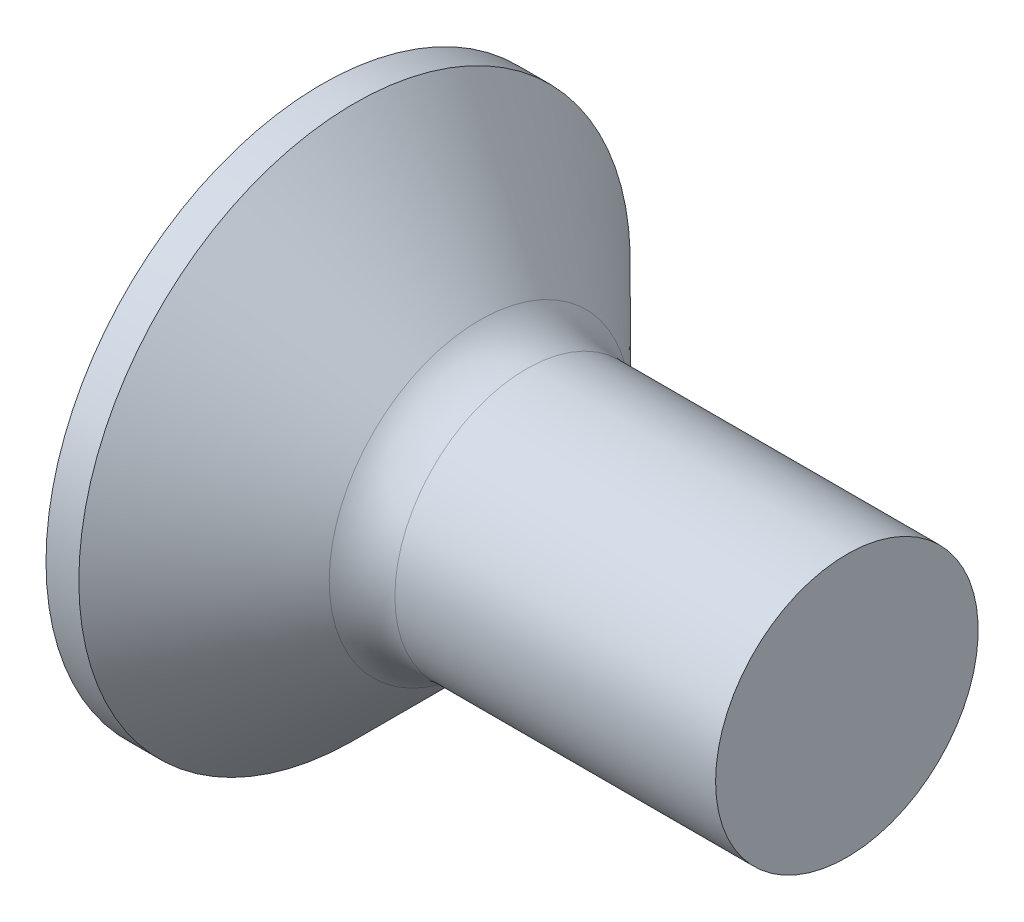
ISO-10303-21;
HEADER;
FILE_DESCRIPTION(('STEP AP214'),'2;1');
FILE_NAME('part.step','',(''),(''),'','','');
FILE_SCHEMA(('AUTOMOTIVE_DESIGN { 1 0 10303 214 1 1 1 1 }'));
ENDSEC;
DATA;
#1=APPLICATION_CONTEXT('core data for automotive mechanical design processes');
#2=APPLICATION_PROTOCOL_DEFINITION('international standard','automotive_design',2000,#1);
#3=PRODUCT_CONTEXT('',#1,'mechanical');
#4=PRODUCT('Part','Part','',(#3));
#5=PRODUCT_RELATED_PRODUCT_CATEGORY('part','',(#4));
#6=PRODUCT_DEFINITION_FORMATION('','',#4);
#7=PRODUCT_DEFINITION_CONTEXT('part definition',#1,'design');
#8=PRODUCT_DEFINITION('design','',#6,#7);
#9=PRODUCT_DEFINITION_SHAPE('','',#8);
#10=(LENGTH_UNIT() NAMED_UNIT(*) SI_UNIT(.MILLI.,.METRE.));
#11=(NAMED_UNIT(*) PLANE_ANGLE_UNIT() SI_UNIT($,.RADIAN.));
#12=(NAMED_UNIT(*) SI_UNIT($,.STERADIAN.) SOLID_ANGLE_UNIT());
#13=UNCERTAINTY_MEASURE_WITH_UNIT(LENGTH_MEASURE(1.E-05),#10,'distance_accuracy_value','');
#14=(GEOMETRIC_REPRESENTATION_CONTEXT(3) GLOBAL_UNCERTAINTY_ASSIGNED_CONTEXT((#13)) GLOBAL_UNIT_ASSIGNED_CONTEXT((#10,
#11,#12)) REPRESENTATION_CONTEXT('',''));
#15=CARTESIAN_POINT('',(0.,0.,0.));
#16=DIRECTION('',(0.,0.,1.));
#17=DIRECTION('',(1.,0.,0.));
#18=AXIS2_PLACEMENT_3D('',#15,#16,#17);
#19=CARTESIAN_POINT('',(0.,0.,0.));
#20=DIRECTION('',(-1.,0.,0.));
#21=DIRECTION('',(0.,0.,1.));
#22=AXIS2_PLACEMENT_3D('',#19,#20,#21);
#23=PLANE('',#22);
#24=CARTESIAN_POINT('',(0.,0.,0.));
#25=DIRECTION('',(-1.,0.,0.));
#26=DIRECTION('',(0.,0.,1.));
#27=AXIS2_PLACEMENT_3D('',#24,#25,#26);
#28=CIRCLE('',#27,4.2);
#29=CARTESIAN_POINT('',(0.,0.,4.2));
#30=VERTEX_POINT('',#29);
#31=EDGE_CURVE('E367',#30,#30,#28,.T.);
#32=ORIENTED_EDGE('',*,*,#31,.T.);
#33=EDGE_LOOP('',(#32));
#34=FACE_BOUND('',#33,.T.);
#35=DIRECTION('',(0.,0.,-1.));
#36=VECTOR('',#35,1.);
#37=CARTESIAN_POINT('',(0.,-0.515000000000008,2.2));
#38=LINE('',#37,#36);
#39=CARTESIAN_POINT('',(0.,-0.515000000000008,2.2));
#40=VERTEX_POINT('',#39);
#41=CARTESIAN_POINT('',(0.,-0.515000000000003,0.887981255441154));
#42=VERTEX_POINT('',#41);
#43=EDGE_CURVE('E305',#40,#42,#38,.T.);
#44=ORIENTED_EDGE('',*,*,#43,.T.);
#45=CARTESIAN_POINT('',(0.,0.,0.));
#46=DIRECTION('',(-1.,0.,0.));
#47=DIRECTION('',(0.,0.,1.));
#48=AXIS2_PLACEMENT_3D('',#45,#46,#47);
#49=CIRCLE('',#48,1.02651629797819);
#50=CARTESIAN_POINT('',(0.,-0.887981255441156,0.515));
#51=VERTEX_POINT('',#50);
#52=EDGE_CURVE('E396',#51,#42,#49,.T.);
#53=ORIENTED_EDGE('',*,*,#52,.F.);
#54=DIRECTION('',(0.,-1.,0.));
#55=VECTOR('',#54,1.);
#56=CARTESIAN_POINT('',(0.,2.2,0.515));
#57=LINE('',#56,#55);
#58=CARTESIAN_POINT('',(0.,-2.2,0.515));
#59=VERTEX_POINT('',#58);
#60=EDGE_CURVE('E331',#51,#59,#57,.T.);
#61=ORIENTED_EDGE('',*,*,#60,.T.);
#62=DIRECTION('',(0.,0.,-1.));
#63=VECTOR('',#62,1.);
#64=CARTESIAN_POINT('',(0.,-2.2,0.515));
#65=LINE('',#64,#63);
#66=CARTESIAN_POINT('',(0.,-2.2,-0.514999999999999));
#67=VERTEX_POINT('',#66);
#68=EDGE_CURVE('E336',#59,#67,#65,.T.);
#69=ORIENTED_EDGE('',*,*,#68,.T.);
#70=DIRECTION('',(0.,1.,0.));
#71=VECTOR('',#70,1.);
#72=CARTESIAN_POINT('',(0.,-2.2,-0.514999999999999));
#73=LINE('',#72,#71);
#74=CARTESIAN_POINT('',(0.,-0.887981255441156,-0.514999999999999));
#75=VERTEX_POINT('',#74);
#76=EDGE_CURVE('E332',#67,#75,#73,.T.);
#77=ORIENTED_EDGE('',*,*,#76,.T.);
#78=CARTESIAN_POINT('',(0.,-0.514999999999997,-0.887981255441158));
#79=VERTEX_POINT('',#78);
#80=EDGE_CURVE('E403',#79,#75,#49,.T.);
#81=ORIENTED_EDGE('',*,*,#80,.F.);
#82=CARTESIAN_POINT('',(0.,-0.514999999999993,-2.2));
#83=VERTEX_POINT('',#82);
#84=EDGE_CURVE('E303',#79,#83,#38,.T.);
#85=ORIENTED_EDGE('',*,*,#84,.T.);
#86=DIRECTION('',(0.,1.,0.));
#87=VECTOR('',#86,1.);
#88=CARTESIAN_POINT('',(0.,-0.514999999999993,-2.2));
#89=LINE('',#88,#87);
#90=CARTESIAN_POINT('',(0.,0.515000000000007,-2.2));
#91=VERTEX_POINT('',#90);
#92=EDGE_CURVE('E284',#83,#91,#89,.T.);
#93=ORIENTED_EDGE('',*,*,#92,.T.);
#94=DIRECTION('',(0.,0.,1.));
#95=VECTOR('',#94,1.);
#96=CARTESIAN_POINT('',(0.,0.515000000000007,-2.2));
#97=LINE('',#96,#95);
#98=CARTESIAN_POINT('',(0.,0.515000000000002,-0.887981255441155));
#99=VERTEX_POINT('',#98);
#100=EDGE_CURVE('E295',#91,#99,#97,.T.);
#101=ORIENTED_EDGE('',*,*,#100,.T.);
#102=CARTESIAN_POINT('',(0.,0.887981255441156,-0.514999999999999));
#103=VERTEX_POINT('',#102);
#104=EDGE_CURVE('E399',#103,#99,#49,.T.);
#105=ORIENTED_EDGE('',*,*,#104,.F.);
#106=CARTESIAN_POINT('',(0.,2.2,-0.514999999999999));
#107=VERTEX_POINT('',#106);
#108=EDGE_CURVE('E342',#103,#107,#73,.T.);
#109=ORIENTED_EDGE('',*,*,#108,.T.);
#110=DIRECTION('',(0.,0.,1.));
#111=VECTOR('',#110,1.);
#112=CARTESIAN_POINT('',(0.,2.2,-0.514999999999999));
#113=LINE('',#112,#111);
#114=CARTESIAN_POINT('',(0.,2.2,0.515));
#115=VERTEX_POINT('',#114);
#116=EDGE_CURVE('E328',#107,#115,#113,.T.);
#117=ORIENTED_EDGE('',*,*,#116,.T.);
#118=CARTESIAN_POINT('',(0.,0.887981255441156,0.515));
#119=VERTEX_POINT('',#118);
#120=EDGE_CURVE('E333',#115,#119,#57,.T.);
#121=ORIENTED_EDGE('',*,*,#120,.T.);
#122=CARTESIAN_POINT('',(0.,0.514999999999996,0.887981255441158));
#123=VERTEX_POINT('',#122);
#124=EDGE_CURVE('E398',#123,#119,#49,.T.);
#125=ORIENTED_EDGE('',*,*,#124,.F.);
#126=CARTESIAN_POINT('',(0.,0.514999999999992,2.2));
#127=VERTEX_POINT('',#126);
#128=EDGE_CURVE('E298',#123,#127,#97,.T.);
#129=ORIENTED_EDGE('',*,*,#128,.T.);
#130=DIRECTION('',(0.,-1.,0.));
#131=VECTOR('',#130,1.);
#132=CARTESIAN_POINT('',(0.,0.514999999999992,2.2));
#133=LINE('',#132,#131);
#134=EDGE_CURVE('E297',#127,#40,#133,.T.);
#135=ORIENTED_EDGE('',*,*,#134,.T.);
#136=EDGE_LOOP('',(#44,#53,#61,#69,#77,#81,#85,#93,#101,#105,#109,#117,#121,#125,#129,#135));
#137=FACE_BOUND('',#136,.T.);
#138=ADVANCED_FACE('F30',(#34,#137),#23,.T.);
#139=CARTESIAN_POINT('',(2.51,-0.948560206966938,0.515));
#140=DIRECTION('',(0.,0.,-1.));
#141=DIRECTION('',(0.,1.,0.));
#142=AXIS2_PLACEMENT_3D('',#139,#140,#141);
#143=PLANE('',#142);
#144=ORIENTED_EDGE('',*,*,#60,.F.);
#145=CARTESIAN_POINT('',(-1.54977564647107,-1.01130800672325,0.515));
#146=CARTESIAN_POINT('',(-1.23788517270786,-0.986826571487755,0.515));
#147=CARTESIAN_POINT('',(-0.92600773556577,-0.962176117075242,0.515));
#148=CARTESIAN_POINT('',(-0.302275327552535,-0.912414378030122,0.515));
#149=CARTESIAN_POINT('',(0.0095796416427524,-0.88730307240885,0.515));
#150=CARTESIAN_POINT('',(0.477326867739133,-0.849200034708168,0.515));
#151=CARTESIAN_POINT('',(0.633236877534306,-0.836426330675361,0.515));
#152=CARTESIAN_POINT('',(0.945041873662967,-0.810710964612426,0.515));
#153=CARTESIAN_POINT('',(1.10093686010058,-0.797769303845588,0.515));
#154=CARTESIAN_POINT('',(1.41270333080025,-0.771692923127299,0.515));
#155=CARTESIAN_POINT('',(1.568574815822,-0.758558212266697,0.515));
#156=CARTESIAN_POINT('',(1.88030267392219,-0.732062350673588,0.515));
#157=CARTESIAN_POINT('',(2.03615904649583,-0.718701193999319,0.515));
#158=CARTESIAN_POINT('',(2.39015155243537,-0.688049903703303,0.515));
#159=CARTESIAN_POINT('',(2.58828060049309,-0.670677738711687,0.515));
#160=CARTESIAN_POINT('',(2.98448796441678,-0.63539350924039,0.515));
#161=CARTESIAN_POINT('',(3.18256628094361,-0.617481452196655,0.515));
#162=CARTESIAN_POINT('',(3.57863215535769,-0.58096323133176,0.515));
#163=CARTESIAN_POINT('',(3.77661972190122,-0.562357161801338,0.515));
#164=CARTESIAN_POINT('',(4.17251625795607,-0.524212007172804,0.515));
#165=CARTESIAN_POINT('',(4.37042522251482,-0.504672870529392,0.515));
#166=CARTESIAN_POINT('',(4.76621979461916,-0.464285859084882,0.515));
#167=CARTESIAN_POINT('',(4.96410533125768,-0.443437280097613,0.515000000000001));
#168=CARTESIAN_POINT('',(5.26075347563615,-0.410686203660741,0.515000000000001));
#169=CARTESIAN_POINT('',(5.35959766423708,-0.399523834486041,0.515000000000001));
#170=CARTESIAN_POINT('',(5.55721694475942,-0.376561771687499,0.515000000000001));
#171=CARTESIAN_POINT('',(5.65599203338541,-0.364762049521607,0.515000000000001));
#172=CARTESIAN_POINT('',(5.85350341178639,-0.340311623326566,0.515000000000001));
#173=CARTESIAN_POINT('',(5.95223963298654,-0.327660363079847,0.515000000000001));
#174=CARTESIAN_POINT('',(6.14954565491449,-0.301187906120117,0.515000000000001));
#175=CARTESIAN_POINT('',(6.24811547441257,-0.28736685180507,0.515000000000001));
#176=CARTESIAN_POINT('',(6.39580251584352,-0.265292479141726,0.515000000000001));
#177=CARTESIAN_POINT('',(6.44501926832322,-0.257707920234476,0.515000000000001));
#178=CARTESIAN_POINT('',(6.54335575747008,-0.241951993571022,0.515000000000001));
#179=CARTESIAN_POINT('',(6.59247550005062,-0.233780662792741,0.515000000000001));
#180=CARTESIAN_POINT('',(6.69060451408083,-0.216664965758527,0.515000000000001));
#181=CARTESIAN_POINT('',(6.73961373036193,-0.207720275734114,0.515000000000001));
#182=CARTESIAN_POINT('',(6.83741121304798,-0.188649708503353,0.515000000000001));
#183=CARTESIAN_POINT('',(6.8861994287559,-0.17852357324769,0.515000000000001));
#184=CARTESIAN_POINT('',(6.93482152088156,-0.167602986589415,0.515000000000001));
#185=B_SPLINE_CURVE_WITH_KNOTS('',3,(#145,#146,#147,#148,#149,#150,#151,#152,#153,#154,#155,
#156,#157,#158,#159,#160,#161,#162,#163,#164,#165,#166,#167,#168,#169,#170,#171,#172,#173,#174,
#175,#176,#177,#178,#179,#180,#181,#182,#183,#184),.UNSPECIFIED.,.F.,.F.,(4,2,2,2,2,2,2,2,2,2,2,
2,2,2,2,2,2,2,2,4),(0.,0.938549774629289,1.87714240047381,2.34643955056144,2.81573317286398,
3.28500476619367,3.75428869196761,4.35095567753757,4.94761444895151,5.54419244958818,
6.14080344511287,6.73773807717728,7.0361540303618,7.33458335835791,7.63320954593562,
7.93179943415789,8.08118980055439,8.23057076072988,8.38001456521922,8.52949107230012),.UNSPECIFIED.);
#186=CARTESIAN_POINT('',(2.51,-0.677477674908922,0.514999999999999));
#187=VERTEX_POINT('',#186);
#188=EDGE_CURVE('E410',#51,#187,#185,.T.);
#189=ORIENTED_EDGE('',*,*,#188,.T.);
#190=DIRECTION('',(0.,-1.,0.));
#191=VECTOR('',#190,1.);
#192=CARTESIAN_POINT('',(2.51,0.948560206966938,0.515));
#193=LINE('',#192,#191);
#194=CARTESIAN_POINT('',(2.51,-0.948560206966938,0.515));
#195=VERTEX_POINT('',#194);
#196=EDGE_CURVE('E356',#187,#195,#193,.T.);
#197=ORIENTED_EDGE('',*,*,#196,.T.);
#198=DIRECTION('',(0.89493436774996,0.446197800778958,0.));
#199=VECTOR('',#198,1.);
#200=CARTESIAN_POINT('',(0.,-2.2,0.515));
#201=LINE('',#200,#199);
#202=EDGE_CURVE('E343',#59,#195,#201,.T.);
#203=ORIENTED_EDGE('',*,*,#202,.F.);
#204=EDGE_LOOP('',(#144,#189,#197,#203));
#205=FACE_BOUND('',#204,.T.);
#206=ADVANCED_FACE('F162',(#205),#143,.T.);
#207=CARTESIAN_POINT('',(2.51,0.948560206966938,0.515));
#208=VERTEX_POINT('',#207);
#209=CARTESIAN_POINT('',(2.51,0.677477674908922,0.514999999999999));
#210=VERTEX_POINT('',#209);
#211=EDGE_CURVE('E357',#208,#210,#193,.T.);
#212=ORIENTED_EDGE('',*,*,#211,.T.);
#213=CARTESIAN_POINT('',(-1.54977564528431,1.01130800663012,0.515));
#214=CARTESIAN_POINT('',(-1.23788517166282,0.986826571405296,0.515));
#215=CARTESIAN_POINT('',(-0.926007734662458,0.962176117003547,0.515));
#216=CARTESIAN_POINT('',(-0.302275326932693,0.91241437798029,0.515));
#217=CARTESIAN_POINT('',(0.0095796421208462,0.887303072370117,0.515));
#218=CARTESIAN_POINT('',(0.477326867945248,0.849200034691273,0.515));
#219=CARTESIAN_POINT('',(0.63323687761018,0.836426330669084,0.515));
#220=CARTESIAN_POINT('',(0.945041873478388,0.810710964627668,0.515));
#221=CARTESIAN_POINT('',(1.10093685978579,0.797769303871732,0.515));
#222=CARTESIAN_POINT('',(1.41270333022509,0.771692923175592,0.515));
#223=CARTESIAN_POINT('',(1.56857481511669,0.758558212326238,0.515));
#224=CARTESIAN_POINT('',(1.8803026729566,0.732062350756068,0.515));
#225=CARTESIAN_POINT('',(2.03615904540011,0.718701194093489,0.515));
#226=CARTESIAN_POINT('',(2.39015155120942,0.688049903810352,0.515));
#227=CARTESIAN_POINT('',(2.58828059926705,0.670677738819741,0.515));
#228=CARTESIAN_POINT('',(2.98448796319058,0.635393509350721,0.515));
#229=CARTESIAN_POINT('',(3.18256627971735,0.617481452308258,0.515));
#230=CARTESIAN_POINT('',(3.57863215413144,0.580963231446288,0.515));
#231=CARTESIAN_POINT('',(3.77661972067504,0.56235716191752,0.515));
#232=CARTESIAN_POINT('',(4.17251625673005,0.524212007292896,0.515));
#233=CARTESIAN_POINT('',(4.37042522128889,0.504672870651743,0.515));
#234=CARTESIAN_POINT('',(4.76621979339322,0.464285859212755,0.515));
#235=CARTESIAN_POINT('',(4.96410533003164,0.443437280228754,0.515));
#236=CARTESIAN_POINT('',(5.26075347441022,0.410686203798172,0.515));
#237=CARTESIAN_POINT('',(5.35959766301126,0.399523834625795,0.515));
#238=CARTESIAN_POINT('',(5.5572169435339,0.376561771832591,0.515));
#239=CARTESIAN_POINT('',(5.65599203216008,0.364762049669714,0.515000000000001));
#240=CARTESIAN_POINT('',(5.85350341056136,0.340311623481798,0.515000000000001));
#241=CARTESIAN_POINT('',(5.95223963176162,0.327660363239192,0.515000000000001));
#242=CARTESIAN_POINT('',(6.14954565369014,0.301187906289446,0.515000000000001));
#243=CARTESIAN_POINT('',(6.24811547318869,0.28736685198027,0.515000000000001));
#244=CARTESIAN_POINT('',(6.39580251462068,0.265292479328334,0.515000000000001));
#245=CARTESIAN_POINT('',(6.44501926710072,0.257707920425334,0.515000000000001));
#246=CARTESIAN_POINT('',(6.54335575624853,0.241951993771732,0.515000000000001));
#247=CARTESIAN_POINT('',(6.5924754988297,0.233780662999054,0.515000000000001));
#248=CARTESIAN_POINT('',(6.69060451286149,0.216664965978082,0.515000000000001));
#249=CARTESIAN_POINT('',(6.73961372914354,0.207720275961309,0.515000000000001));
#250=CARTESIAN_POINT('',(6.83741121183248,0.18864970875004,0.515000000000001));
#251=CARTESIAN_POINT('',(6.88619942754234,0.178523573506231,0.515000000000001));
#252=CARTESIAN_POINT('',(6.9348215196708,0.167602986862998,0.515000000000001));
#253=B_SPLINE_CURVE_WITH_KNOTS('',3,(#213,#214,#215,#216,#217,#218,#219,#220,#221,#222,#223,
#224,#225,#226,#227,#228,#229,#230,#231,#232,#233,#234,#235,#236,#237,#238,#239,#240,#241,#242,
#243,#244,#245,#246,#247,#248,#249,#250,#251,#252),.UNSPECIFIED.,.F.,.F.,(4,2,2,2,2,2,2,2,2,2,2,
2,2,2,2,2,2,2,2,4),(0.,0.938549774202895,1.87714239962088,2.34643954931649,2.81573317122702,
3.2850047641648,3.75428868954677,4.35095567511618,4.9476144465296,5.544192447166,
6.1408034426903,6.73773807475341,7.03615402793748,7.33458335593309,7.63320954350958,
7.93179943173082,8.08118979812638,8.23057075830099,8.38001456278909,8.5294910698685),.UNSPECIFIED.);
#254=EDGE_CURVE('E222',#210,#119,#253,.F.);
#255=ORIENTED_EDGE('',*,*,#254,.T.);
#256=ORIENTED_EDGE('',*,*,#120,.F.);
#257=DIRECTION('',(0.89493436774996,-0.446197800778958,0.));
#258=VECTOR('',#257,1.);
#259=CARTESIAN_POINT('',(0.,2.2,0.515));
#260=LINE('',#259,#258);
#261=EDGE_CURVE('E58',#115,#208,#260,.T.);
#262=ORIENTED_EDGE('',*,*,#261,.T.);
#263=EDGE_LOOP('',(#212,#255,#256,#262));
#264=FACE_BOUND('',#263,.T.);
#265=ADVANCED_FACE('F167',(#264),#143,.T.);
#266=CARTESIAN_POINT('',(2.51,0.948560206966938,-0.515));
#267=DIRECTION('',(0.,0.,1.));
#268=DIRECTION('',(1.,0.,0.));
#269=AXIS2_PLACEMENT_3D('',#266,#267,#268);
#270=PLANE('',#269);
#271=DIRECTION('',(0.,1.,0.));
#272=VECTOR('',#271,1.);
#273=CARTESIAN_POINT('',(2.51,-0.948560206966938,-0.515));
#274=LINE('',#273,#272);
#275=CARTESIAN_POINT('',(2.51,-0.948560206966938,-0.515));
#276=VERTEX_POINT('',#275);
#277=CARTESIAN_POINT('',(2.51,-0.677477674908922,-0.514999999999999));
#278=VERTEX_POINT('',#277);
#279=EDGE_CURVE('E307',#276,#278,#274,.T.);
#280=ORIENTED_EDGE('',*,*,#279,.T.);
#281=CARTESIAN_POINT('',(-1.54977564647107,-1.01130800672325,-0.514999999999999));
#282=CARTESIAN_POINT('',(-1.23788517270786,-0.986826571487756,-0.514999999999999));
#283=CARTESIAN_POINT('',(-0.92600773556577,-0.962176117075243,-0.514999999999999));
#284=CARTESIAN_POINT('',(-0.302275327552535,-0.912414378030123,-0.514999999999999));
#285=CARTESIAN_POINT('',(0.00957964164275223,-0.88730307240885,-0.514999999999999));
#286=CARTESIAN_POINT('',(0.477326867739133,-0.849200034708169,-0.514999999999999));
#287=CARTESIAN_POINT('',(0.633236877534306,-0.836426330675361,-0.515));
#288=CARTESIAN_POINT('',(0.945041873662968,-0.810710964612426,-0.515));
#289=CARTESIAN_POINT('',(1.10093686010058,-0.797769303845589,-0.515));
#290=CARTESIAN_POINT('',(1.41270333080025,-0.771692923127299,-0.515));
#291=CARTESIAN_POINT('',(1.568574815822,-0.758558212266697,-0.515));
#292=CARTESIAN_POINT('',(1.88030267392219,-0.732062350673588,-0.515));
#293=CARTESIAN_POINT('',(2.03615904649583,-0.718701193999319,-0.515));
#294=CARTESIAN_POINT('',(2.39015155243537,-0.688049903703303,-0.515));
#295=CARTESIAN_POINT('',(2.58828060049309,-0.670677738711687,-0.515));
#296=CARTESIAN_POINT('',(2.98448796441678,-0.63539350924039,-0.515));
#297=CARTESIAN_POINT('',(3.18256628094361,-0.617481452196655,-0.515));
#298=CARTESIAN_POINT('',(3.57863215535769,-0.58096323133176,-0.515));
#299=CARTESIAN_POINT('',(3.77661972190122,-0.562357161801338,-0.515));
#300=CARTESIAN_POINT('',(4.17251625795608,-0.524212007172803,-0.515000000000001));
#301=CARTESIAN_POINT('',(4.37042522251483,-0.504672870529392,-0.515000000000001));
#302=CARTESIAN_POINT('',(4.76621979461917,-0.464285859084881,-0.515000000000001));
#303=CARTESIAN_POINT('',(4.96410533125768,-0.443437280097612,-0.515000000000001));
#304=CARTESIAN_POINT('',(5.26075347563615,-0.410686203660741,-0.515000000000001));
#305=CARTESIAN_POINT('',(5.35959766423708,-0.39952383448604,-0.515000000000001));
#306=CARTESIAN_POINT('',(5.55721694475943,-0.376561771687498,-0.515000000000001));
#307=CARTESIAN_POINT('',(5.65599203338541,-0.364762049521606,-0.515000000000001));
#308=CARTESIAN_POINT('',(5.8535034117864,-0.340311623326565,-0.515000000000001));
#309=CARTESIAN_POINT('',(5.95223963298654,-0.327660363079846,-0.515000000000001));
#310=CARTESIAN_POINT('',(6.14954565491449,-0.301187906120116,-0.515000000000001));
#311=CARTESIAN_POINT('',(6.24811547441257,-0.287366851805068,-0.515000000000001));
#312=CARTESIAN_POINT('',(6.39580251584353,-0.265292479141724,-0.515000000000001));
#313=CARTESIAN_POINT('',(6.44501926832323,-0.257707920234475,-0.515000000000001));
#314=CARTESIAN_POINT('',(6.54335575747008,-0.24195199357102,-0.515000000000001));
#315=CARTESIAN_POINT('',(6.59247550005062,-0.233780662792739,-0.515000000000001));
#316=CARTESIAN_POINT('',(6.69060451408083,-0.216664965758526,-0.515000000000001));
#317=CARTESIAN_POINT('',(6.73961373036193,-0.207720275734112,-0.515000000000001));
#318=CARTESIAN_POINT('',(6.83741121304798,-0.188649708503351,-0.515000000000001));
#319=CARTESIAN_POINT('',(6.88619942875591,-0.178523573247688,-0.515000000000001));
#320=CARTESIAN_POINT('',(6.93482152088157,-0.167602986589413,-0.515000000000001));
#321=B_SPLINE_CURVE_WITH_KNOTS('',3,(#281,#282,#283,#284,#285,#286,#287,#288,#289,#290,#291,
#292,#293,#294,#295,#296,#297,#298,#299,#300,#301,#302,#303,#304,#305,#306,#307,#308,#309,#310,
#311,#312,#313,#314,#315,#316,#317,#318,#319,#320),.UNSPECIFIED.,.F.,.F.,(4,2,2,2,2,2,2,2,2,2,2,
2,2,2,2,2,2,2,2,4),(0.,0.938549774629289,1.87714240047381,2.34643955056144,2.81573317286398,
3.28500476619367,3.75428869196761,4.35095567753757,4.94761444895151,5.54419244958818,
6.14080344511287,6.73773807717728,7.0361540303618,7.33458335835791,7.63320954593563,
7.93179943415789,8.0811898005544,8.23057076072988,8.38001456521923,8.52949107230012),.UNSPECIFIED.);
#322=EDGE_CURVE('E216',#278,#75,#321,.F.);
#323=ORIENTED_EDGE('',*,*,#322,.T.);
#324=ORIENTED_EDGE('',*,*,#76,.F.);
#325=DIRECTION('',(0.89493436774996,0.446197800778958,0.));
#326=VECTOR('',#325,1.);
#327=CARTESIAN_POINT('',(0.,-2.2,-0.514999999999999));
#328=LINE('',#327,#326);
#329=EDGE_CURVE('E346',#67,#276,#328,.T.);
#330=ORIENTED_EDGE('',*,*,#329,.T.);
#331=EDGE_LOOP('',(#280,#323,#324,#330));
#332=FACE_BOUND('',#331,.T.);
#333=ADVANCED_FACE('F202',(#332),#270,.T.);
#334=ORIENTED_EDGE('',*,*,#108,.F.);
#335=CARTESIAN_POINT('',(-1.54977564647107,1.01130800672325,-0.514999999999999));
#336=CARTESIAN_POINT('',(-1.23788517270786,0.986826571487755,-0.514999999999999));
#337=CARTESIAN_POINT('',(-0.92600773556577,0.962176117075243,-0.514999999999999));
#338=CARTESIAN_POINT('',(-0.302275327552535,0.912414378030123,-0.514999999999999));
#339=CARTESIAN_POINT('',(0.00957964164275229,0.88730307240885,-0.514999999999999));
#340=CARTESIAN_POINT('',(0.477326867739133,0.849200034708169,-0.514999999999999));
#341=CARTESIAN_POINT('',(0.633236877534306,0.836426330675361,-0.515));
#342=CARTESIAN_POINT('',(0.945041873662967,0.810710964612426,-0.515));
#343=CARTESIAN_POINT('',(1.10093686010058,0.797769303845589,-0.515));
#344=CARTESIAN_POINT('',(1.41270333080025,0.771692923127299,-0.515));
#345=CARTESIAN_POINT('',(1.568574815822,0.758558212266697,-0.515));
#346=CARTESIAN_POINT('',(1.88030267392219,0.732062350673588,-0.515));
#347=CARTESIAN_POINT('',(2.03615904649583,0.718701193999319,-0.515));
#348=CARTESIAN_POINT('',(2.39015155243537,0.688049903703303,-0.515));
#349=CARTESIAN_POINT('',(2.58828060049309,0.670677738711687,-0.515));
#350=CARTESIAN_POINT('',(2.98448796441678,0.63539350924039,-0.515));
#351=CARTESIAN_POINT('',(3.18256628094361,0.617481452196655,-0.515));
#352=CARTESIAN_POINT('',(3.57863215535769,0.58096323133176,-0.515));
#353=CARTESIAN_POINT('',(3.77661972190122,0.562357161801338,-0.515));
#354=CARTESIAN_POINT('',(4.17251625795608,0.524212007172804,-0.515000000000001));
#355=CARTESIAN_POINT('',(4.37042522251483,0.504672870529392,-0.515000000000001));
#356=CARTESIAN_POINT('',(4.76621979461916,0.464285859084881,-0.515000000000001));
#357=CARTESIAN_POINT('',(4.96410533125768,0.443437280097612,-0.515000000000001));
#358=CARTESIAN_POINT('',(5.26075347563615,0.410686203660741,-0.515000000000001));
#359=CARTESIAN_POINT('',(5.35959766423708,0.39952383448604,-0.515000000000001));
#360=CARTESIAN_POINT('',(5.55721694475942,0.376561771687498,-0.515000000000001));
#361=CARTESIAN_POINT('',(5.65599203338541,0.364762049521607,-0.515000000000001));
#362=CARTESIAN_POINT('',(5.8535034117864,0.340311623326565,-0.515000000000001));
#363=CARTESIAN_POINT('',(5.95223963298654,0.327660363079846,-0.515000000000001));
#364=CARTESIAN_POINT('',(6.14954565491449,0.301187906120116,-0.515000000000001));
#365=CARTESIAN_POINT('',(6.24811547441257,0.287366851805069,-0.515000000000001));
#366=CARTESIAN_POINT('',(6.39580251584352,0.265292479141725,-0.515000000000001));
#367=CARTESIAN_POINT('',(6.44501926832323,0.257707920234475,-0.515000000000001));
#368=CARTESIAN_POINT('',(6.54335575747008,0.24195199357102,-0.515000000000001));
#369=CARTESIAN_POINT('',(6.59247550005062,0.233780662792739,-0.515000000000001));
#370=CARTESIAN_POINT('',(6.69060451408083,0.216664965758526,-0.515000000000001));
#371=CARTESIAN_POINT('',(6.73961373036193,0.207720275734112,-0.515000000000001));
#372=CARTESIAN_POINT('',(6.83741121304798,0.188649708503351,-0.515000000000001));
#373=CARTESIAN_POINT('',(6.88619942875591,0.178523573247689,-0.515000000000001));
#374=CARTESIAN_POINT('',(6.93482152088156,0.167602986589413,-0.515000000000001));
#375=B_SPLINE_CURVE_WITH_KNOTS('',3,(#335,#336,#337,#338,#339,#340,#341,#342,#343,#344,#345,
#346,#347,#348,#349,#350,#351,#352,#353,#354,#355,#356,#357,#358,#359,#360,#361,#362,#363,#364,
#365,#366,#367,#368,#369,#370,#371,#372,#373,#374),.UNSPECIFIED.,.F.,.F.,(4,2,2,2,2,2,2,2,2,2,2,
2,2,2,2,2,2,2,2,4),(0.,0.938549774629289,1.87714240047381,2.34643955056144,2.81573317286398,
3.28500476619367,3.75428869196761,4.35095567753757,4.94761444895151,5.54419244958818,
6.14080344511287,6.73773807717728,7.0361540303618,7.33458335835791,7.63320954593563,
7.93179943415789,8.0811898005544,8.23057076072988,8.38001456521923,8.52949107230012),.UNSPECIFIED.);
#376=CARTESIAN_POINT('',(2.51,0.677477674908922,-0.514999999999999));
#377=VERTEX_POINT('',#376);
#378=EDGE_CURVE('E210',#103,#377,#375,.T.);
#379=ORIENTED_EDGE('',*,*,#378,.T.);
#380=CARTESIAN_POINT('',(2.51,0.948560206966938,-0.515));
#381=VERTEX_POINT('',#380);
#382=EDGE_CURVE('E304',#377,#381,#274,.T.);
#383=ORIENTED_EDGE('',*,*,#382,.T.);
#384=DIRECTION('',(0.89493436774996,-0.446197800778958,0.));
#385=VECTOR('',#384,1.);
#386=CARTESIAN_POINT('',(0.,2.2,-0.514999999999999));
#387=LINE('',#386,#385);
#388=EDGE_CURVE('E350',#107,#381,#387,.T.);
#389=ORIENTED_EDGE('',*,*,#388,.F.);
#390=EDGE_LOOP('',(#334,#379,#383,#389));
#391=FACE_BOUND('',#390,.T.);
#392=ADVANCED_FACE('F194',(#391),#270,.T.);
#393=CARTESIAN_POINT('',(2.51,-0.948560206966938,-0.515));
#394=DIRECTION('',(-1.,0.,0.));
#395=DIRECTION('',(0.,0.,1.));
#396=AXIS2_PLACEMENT_3D('',#393,#394,#395);
#397=PLANE('',#396);
#398=ORIENTED_EDGE('',*,*,#196,.F.);
#399=CARTESIAN_POINT('',(2.51,0.,0.));
#400=DIRECTION('',(-1.,0.,0.));
#401=DIRECTION('',(0.,0.,1.));
#402=AXIS2_PLACEMENT_3D('',#399,#400,#401);
#403=CIRCLE('',#402,0.850999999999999);
#404=EDGE_CURVE('E387',#278,#187,#403,.T.);
#405=ORIENTED_EDGE('',*,*,#404,.F.);
#406=ORIENTED_EDGE('',*,*,#279,.F.);
#407=DIRECTION('',(0.,0.,-1.));
#408=VECTOR('',#407,1.);
#409=CARTESIAN_POINT('',(2.51,-0.948560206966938,0.515));
#410=LINE('',#409,#408);
#411=EDGE_CURVE('E353',#195,#276,#410,.T.);
#412=ORIENTED_EDGE('',*,*,#411,.F.);
#413=EDGE_LOOP('',(#398,#405,#406,#412));
#414=FACE_BOUND('',#413,.T.);
#415=ADVANCED_FACE('F190',(#414),#397,.T.);
#416=DIRECTION('',(0.,0.,-1.));
#417=VECTOR('',#416,1.);
#418=CARTESIAN_POINT('',(2.51,-0.515000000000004,0.948560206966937));
#419=LINE('',#418,#417);
#420=CARTESIAN_POINT('',(2.51,-0.514999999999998,-0.677477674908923));
#421=VERTEX_POINT('',#420);
#422=CARTESIAN_POINT('',(2.51,-0.514999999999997,-0.94856020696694));
#423=VERTEX_POINT('',#422);
#424=EDGE_CURVE('E320',#421,#423,#419,.T.);
#425=ORIENTED_EDGE('',*,*,#424,.F.);
#426=CARTESIAN_POINT('',(2.51,0.515000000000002,-0.677477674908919));
#427=VERTEX_POINT('',#426);
#428=EDGE_CURVE('E394',#427,#421,#403,.T.);
#429=ORIENTED_EDGE('',*,*,#428,.F.);
#430=DIRECTION('',(0.,0.,1.));
#431=VECTOR('',#430,1.);
#432=CARTESIAN_POINT('',(2.51,0.515000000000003,-0.948560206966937));
#433=LINE('',#432,#431);
#434=CARTESIAN_POINT('',(2.51,0.515000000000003,-0.948560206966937));
#435=VERTEX_POINT('',#434);
#436=EDGE_CURVE('E321',#435,#427,#433,.T.);
#437=ORIENTED_EDGE('',*,*,#436,.F.);
#438=DIRECTION('',(0.,1.,0.));
#439=VECTOR('',#438,1.);
#440=CARTESIAN_POINT('',(2.51,-0.514999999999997,-0.94856020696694));
#441=LINE('',#440,#439);
#442=EDGE_CURVE('E287',#423,#435,#441,.T.);
#443=ORIENTED_EDGE('',*,*,#442,.F.);
#444=EDGE_LOOP('',(#425,#429,#437,#443));
#445=FACE_BOUND('',#444,.T.);
#446=ADVANCED_FACE('F193',(#445),#397,.T.);
#447=ORIENTED_EDGE('',*,*,#382,.F.);
#448=EDGE_CURVE('E397',#210,#377,#403,.T.);
#449=ORIENTED_EDGE('',*,*,#448,.F.);
#450=ORIENTED_EDGE('',*,*,#211,.F.);
#451=DIRECTION('',(0.,0.,1.));
#452=VECTOR('',#451,1.);
#453=CARTESIAN_POINT('',(2.51,0.948560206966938,-0.515));
#454=LINE('',#453,#452);
#455=EDGE_CURVE('E354',#381,#208,#454,.T.);
#456=ORIENTED_EDGE('',*,*,#455,.F.);
#457=EDGE_LOOP('',(#447,#449,#450,#456));
#458=FACE_BOUND('',#457,.T.);
#459=ADVANCED_FACE('F426',(#458),#397,.T.);
#460=CARTESIAN_POINT('',(2.51,0.514999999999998,0.677477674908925));
#461=VERTEX_POINT('',#460);
#462=CARTESIAN_POINT('',(2.51,0.514999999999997,0.94856020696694));
#463=VERTEX_POINT('',#462);
#464=EDGE_CURVE('E327',#461,#463,#433,.T.);
#465=ORIENTED_EDGE('',*,*,#464,.F.);
#466=CARTESIAN_POINT('',(2.51,-0.515000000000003,0.677477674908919));
#467=VERTEX_POINT('',#466);
#468=EDGE_CURVE('E395',#467,#461,#403,.T.);
#469=ORIENTED_EDGE('',*,*,#468,.F.);
#470=CARTESIAN_POINT('',(2.51,-0.515000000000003,0.948560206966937));
#471=VERTEX_POINT('',#470);
#472=EDGE_CURVE('E322',#471,#467,#419,.T.);
#473=ORIENTED_EDGE('',*,*,#472,.F.);
#474=DIRECTION('',(0.,-1.,0.));
#475=VECTOR('',#474,1.);
#476=CARTESIAN_POINT('',(2.51,0.514999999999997,0.94856020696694));
#477=LINE('',#476,#475);
#478=EDGE_CURVE('E317',#463,#471,#477,.T.);
#479=ORIENTED_EDGE('',*,*,#478,.F.);
#480=EDGE_LOOP('',(#465,#469,#473,#479));
#481=FACE_BOUND('',#480,.T.);
#482=ADVANCED_FACE('F196',(#481),#397,.T.);
#483=CARTESIAN_POINT('',(2.51,-0.514999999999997,-0.94856020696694));
#484=DIRECTION('',(0.,1.,0.));
#485=DIRECTION('',(0.,0.,1.));
#486=AXIS2_PLACEMENT_3D('',#483,#484,#485);
#487=PLANE('',#486);
#488=ORIENTED_EDGE('',*,*,#84,.F.);
#489=CARTESIAN_POINT('',(-1.54977564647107,-0.514999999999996,-1.01130800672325));
#490=CARTESIAN_POINT('',(-1.23788517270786,-0.514999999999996,-0.986826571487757));
#491=CARTESIAN_POINT('',(-0.92600773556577,-0.514999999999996,-0.962176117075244));
#492=CARTESIAN_POINT('',(-0.302275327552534,-0.514999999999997,-0.912414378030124));
#493=CARTESIAN_POINT('',(0.00957964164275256,-0.514999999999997,-0.887303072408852));
#494=CARTESIAN_POINT('',(0.477326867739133,-0.514999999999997,-0.84920003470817));
#495=CARTESIAN_POINT('',(0.633236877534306,-0.514999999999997,-0.836426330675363));
#496=CARTESIAN_POINT('',(0.945041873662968,-0.514999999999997,-0.810710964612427));
#497=CARTESIAN_POINT('',(1.10093686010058,-0.514999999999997,-0.79776930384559));
#498=CARTESIAN_POINT('',(1.41270333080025,-0.514999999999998,-0.771692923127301));
#499=CARTESIAN_POINT('',(1.568574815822,-0.514999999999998,-0.758558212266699));
#500=CARTESIAN_POINT('',(1.88030267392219,-0.514999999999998,-0.73206235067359));
#501=CARTESIAN_POINT('',(2.03615904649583,-0.514999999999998,-0.718701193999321));
#502=CARTESIAN_POINT('',(2.39015155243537,-0.514999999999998,-0.688049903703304));
#503=CARTESIAN_POINT('',(2.58828060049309,-0.514999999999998,-0.670677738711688));
#504=CARTESIAN_POINT('',(2.98448796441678,-0.514999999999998,-0.635393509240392));
#505=CARTESIAN_POINT('',(3.18256628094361,-0.514999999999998,-0.617481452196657));
#506=CARTESIAN_POINT('',(3.57863215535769,-0.514999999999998,-0.580963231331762));
#507=CARTESIAN_POINT('',(3.77661972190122,-0.514999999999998,-0.56235716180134));
#508=CARTESIAN_POINT('',(4.17251625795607,-0.514999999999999,-0.524212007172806));
#509=CARTESIAN_POINT('',(4.37042522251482,-0.514999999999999,-0.504672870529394));
#510=CARTESIAN_POINT('',(4.76621979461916,-0.514999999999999,-0.464285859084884));
#511=CARTESIAN_POINT('',(4.96410533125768,-0.514999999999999,-0.443437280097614));
#512=CARTESIAN_POINT('',(5.26075347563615,-0.514999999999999,-0.410686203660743));
#513=CARTESIAN_POINT('',(5.35959766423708,-0.514999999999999,-0.399523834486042));
#514=CARTESIAN_POINT('',(5.55721694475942,-0.514999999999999,-0.3765617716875));
#515=CARTESIAN_POINT('',(5.65599203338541,-0.514999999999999,-0.364762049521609));
#516=CARTESIAN_POINT('',(5.8535034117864,-0.514999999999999,-0.340311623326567));
#517=CARTESIAN_POINT('',(5.95223963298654,-0.514999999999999,-0.327660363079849));
#518=CARTESIAN_POINT('',(6.14954565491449,-0.515,-0.301187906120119));
#519=CARTESIAN_POINT('',(6.24811547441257,-0.515,-0.287366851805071));
#520=CARTESIAN_POINT('',(6.39580251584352,-0.515,-0.265292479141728));
#521=CARTESIAN_POINT('',(6.44501926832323,-0.515,-0.257707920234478));
#522=CARTESIAN_POINT('',(6.54335575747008,-0.515,-0.241951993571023));
#523=CARTESIAN_POINT('',(6.59247550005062,-0.515,-0.233780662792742));
#524=CARTESIAN_POINT('',(6.69060451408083,-0.515,-0.216664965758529));
#525=CARTESIAN_POINT('',(6.73961373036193,-0.515,-0.207720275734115));
#526=CARTESIAN_POINT('',(6.83741121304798,-0.515,-0.188649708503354));
#527=CARTESIAN_POINT('',(6.88619942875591,-0.515,-0.178523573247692));
#528=CARTESIAN_POINT('',(6.93482152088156,-0.515,-0.167602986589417));
#529=B_SPLINE_CURVE_WITH_KNOTS('',3,(#489,#490,#491,#492,#493,#494,#495,#496,#497,#498,#499,
#500,#501,#502,#503,#504,#505,#506,#507,#508,#509,#510,#511,#512,#513,#514,#515,#516,#517,#518,
#519,#520,#521,#522,#523,#524,#525,#526,#527,#528),.UNSPECIFIED.,.F.,.F.,(4,2,2,2,2,2,2,2,2,2,2,
2,2,2,2,2,2,2,2,4),(0.,0.938549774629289,1.87714240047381,2.34643955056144,2.81573317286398,
3.28500476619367,3.75428869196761,4.35095567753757,4.94761444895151,5.54419244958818,
6.14080344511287,6.73773807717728,7.03615403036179,7.33458335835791,7.63320954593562,
7.93179943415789,8.08118980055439,8.23057076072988,8.38001456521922,8.52949107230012),.UNSPECIFIED.);
#530=EDGE_CURVE('E247',#79,#421,#529,.T.);
#531=ORIENTED_EDGE('',*,*,#530,.T.);
#532=ORIENTED_EDGE('',*,*,#424,.T.);
#533=DIRECTION('',(0.89493436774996,0.,0.446197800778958));
#534=VECTOR('',#533,1.);
#535=CARTESIAN_POINT('',(0.,-0.514999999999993,-2.2));
#536=LINE('',#535,#534);
#537=EDGE_CURVE('E290',#83,#423,#536,.T.);
#538=ORIENTED_EDGE('',*,*,#537,.F.);
#539=EDGE_LOOP('',(#488,#531,#532,#538));
#540=FACE_BOUND('',#539,.T.);
#541=ADVANCED_FACE('F253',(#540),#487,.T.);
#542=CARTESIAN_POINT('',(2.51,0.514999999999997,0.94856020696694));
#543=DIRECTION('',(0.,-1.,0.));
#544=DIRECTION('',(1.,0.,0.));
#545=AXIS2_PLACEMENT_3D('',#542,#543,#544);
#546=PLANE('',#545);
#547=ORIENTED_EDGE('',*,*,#436,.T.);
#548=CARTESIAN_POINT('',(-1.54977564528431,0.515000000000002,-1.01130800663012));
#549=CARTESIAN_POINT('',(-1.23788517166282,0.515000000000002,-0.986826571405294));
#550=CARTESIAN_POINT('',(-0.926007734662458,0.515000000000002,-0.962176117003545));
#551=CARTESIAN_POINT('',(-0.302275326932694,0.515000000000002,-0.912414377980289));
#552=CARTESIAN_POINT('',(0.00957964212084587,0.515000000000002,-0.887303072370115));
#553=CARTESIAN_POINT('',(0.477326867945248,0.515000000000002,-0.849200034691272));
#554=CARTESIAN_POINT('',(0.63323687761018,0.515000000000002,-0.836426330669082));
#555=CARTESIAN_POINT('',(0.945041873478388,0.515000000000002,-0.810710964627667));
#556=CARTESIAN_POINT('',(1.10093685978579,0.515000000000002,-0.79776930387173));
#557=CARTESIAN_POINT('',(1.41270333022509,0.515000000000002,-0.77169292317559));
#558=CARTESIAN_POINT('',(1.56857481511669,0.515000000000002,-0.758558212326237));
#559=CARTESIAN_POINT('',(1.8803026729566,0.515000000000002,-0.732062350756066));
#560=CARTESIAN_POINT('',(2.03615904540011,0.515000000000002,-0.718701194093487));
#561=CARTESIAN_POINT('',(2.39015155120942,0.515000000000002,-0.68804990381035));
#562=CARTESIAN_POINT('',(2.58828059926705,0.515000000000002,-0.670677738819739));
#563=CARTESIAN_POINT('',(2.98448796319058,0.515000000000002,-0.635393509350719));
#564=CARTESIAN_POINT('',(3.18256627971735,0.515000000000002,-0.617481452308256));
#565=CARTESIAN_POINT('',(3.57863215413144,0.515000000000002,-0.580963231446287));
#566=CARTESIAN_POINT('',(3.77661972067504,0.515000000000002,-0.562357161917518));
#567=CARTESIAN_POINT('',(4.17251625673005,0.515000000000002,-0.524212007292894));
#568=CARTESIAN_POINT('',(4.37042522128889,0.515000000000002,-0.504672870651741));
#569=CARTESIAN_POINT('',(4.76621979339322,0.515000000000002,-0.464285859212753));
#570=CARTESIAN_POINT('',(4.96410533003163,0.515000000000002,-0.443437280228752));
#571=CARTESIAN_POINT('',(5.26075347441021,0.515000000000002,-0.410686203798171));
#572=CARTESIAN_POINT('',(5.35959766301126,0.515000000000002,-0.399523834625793));
#573=CARTESIAN_POINT('',(5.5572169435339,0.515000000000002,-0.376561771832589));
#574=CARTESIAN_POINT('',(5.65599203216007,0.515000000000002,-0.364762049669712));
#575=CARTESIAN_POINT('',(5.85350341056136,0.515000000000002,-0.340311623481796));
#576=CARTESIAN_POINT('',(5.95223963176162,0.515000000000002,-0.32766036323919));
#577=CARTESIAN_POINT('',(6.14954565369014,0.515000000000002,-0.301187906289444));
#578=CARTESIAN_POINT('',(6.24811547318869,0.515000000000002,-0.287366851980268));
#579=CARTESIAN_POINT('',(6.39580251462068,0.515000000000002,-0.265292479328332));
#580=CARTESIAN_POINT('',(6.44501926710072,0.515000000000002,-0.257707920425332));
#581=CARTESIAN_POINT('',(6.54335575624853,0.515000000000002,-0.24195199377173));
#582=CARTESIAN_POINT('',(6.5924754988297,0.515000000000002,-0.233780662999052));
#583=CARTESIAN_POINT('',(6.69060451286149,0.515000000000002,-0.216664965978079));
#584=CARTESIAN_POINT('',(6.73961372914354,0.515000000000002,-0.207720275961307));
#585=CARTESIAN_POINT('',(6.83741121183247,0.515000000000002,-0.188649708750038));
#586=CARTESIAN_POINT('',(6.88619942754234,0.515000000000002,-0.178523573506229));
#587=CARTESIAN_POINT('',(6.9348215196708,0.515000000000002,-0.167602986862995));
#588=B_SPLINE_CURVE_WITH_KNOTS('',3,(#548,#549,#550,#551,#552,#553,#554,#555,#556,#557,#558,
#559,#560,#561,#562,#563,#564,#565,#566,#567,#568,#569,#570,#571,#572,#573,#574,#575,#576,#577,
#578,#579,#580,#581,#582,#583,#584,#585,#586,#587),.UNSPECIFIED.,.F.,.F.,(4,2,2,2,2,2,2,2,2,2,2,
2,2,2,2,2,2,2,2,4),(0.,0.938549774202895,1.87714239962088,2.34643954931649,2.81573317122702,
3.2850047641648,3.75428868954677,4.35095567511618,4.9476144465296,5.544192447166,
6.1408034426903,6.7377380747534,7.03615402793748,7.33458335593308,7.63320954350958,
7.93179943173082,8.08118979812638,8.23057075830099,8.38001456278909,8.5294910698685),.UNSPECIFIED.);
#589=EDGE_CURVE('E242',#427,#99,#588,.F.);
#590=ORIENTED_EDGE('',*,*,#589,.T.);
#591=ORIENTED_EDGE('',*,*,#100,.F.);
#592=DIRECTION('',(0.89493436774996,0.,0.446197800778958));
#593=VECTOR('',#592,1.);
#594=CARTESIAN_POINT('',(0.,0.515000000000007,-2.2));
#595=LINE('',#594,#593);
#596=EDGE_CURVE('E280',#91,#435,#595,.T.);
#597=ORIENTED_EDGE('',*,*,#596,.T.);
#598=EDGE_LOOP('',(#547,#590,#591,#597));
#599=FACE_BOUND('',#598,.T.);
#600=ADVANCED_FACE('F256',(#599),#546,.T.);
#601=ORIENTED_EDGE('',*,*,#472,.T.);
#602=CARTESIAN_POINT('',(-1.54977564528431,-0.515000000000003,1.01130800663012));
#603=CARTESIAN_POINT('',(-1.23788517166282,-0.515000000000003,0.986826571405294));
#604=CARTESIAN_POINT('',(-0.926007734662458,-0.515000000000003,0.962176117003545));
#605=CARTESIAN_POINT('',(-0.302275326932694,-0.515000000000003,0.912414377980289));
#606=CARTESIAN_POINT('',(0.00957964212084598,-0.515000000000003,0.887303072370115));
#607=CARTESIAN_POINT('',(0.477326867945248,-0.515000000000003,0.849200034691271));
#608=CARTESIAN_POINT('',(0.633236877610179,-0.515000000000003,0.836426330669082));
#609=CARTESIAN_POINT('',(0.945041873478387,-0.515000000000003,0.810710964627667));
#610=CARTESIAN_POINT('',(1.10093685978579,-0.515000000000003,0.79776930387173));
#611=CARTESIAN_POINT('',(1.41270333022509,-0.515000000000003,0.77169292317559));
#612=CARTESIAN_POINT('',(1.56857481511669,-0.515000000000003,0.758558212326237));
#613=CARTESIAN_POINT('',(1.8803026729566,-0.515000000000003,0.732062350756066));
#614=CARTESIAN_POINT('',(2.03615904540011,-0.515000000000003,0.718701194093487));
#615=CARTESIAN_POINT('',(2.39015155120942,-0.515000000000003,0.68804990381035));
#616=CARTESIAN_POINT('',(2.58828059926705,-0.515000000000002,0.670677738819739));
#617=CARTESIAN_POINT('',(2.98448796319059,-0.515000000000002,0.635393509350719));
#618=CARTESIAN_POINT('',(3.18256627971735,-0.515000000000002,0.617481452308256));
#619=CARTESIAN_POINT('',(3.57863215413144,-0.515000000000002,0.580963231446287));
#620=CARTESIAN_POINT('',(3.77661972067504,-0.515000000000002,0.562357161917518));
#621=CARTESIAN_POINT('',(4.17251625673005,-0.515000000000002,0.524212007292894));
#622=CARTESIAN_POINT('',(4.37042522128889,-0.515000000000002,0.504672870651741));
#623=CARTESIAN_POINT('',(4.76621979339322,-0.515000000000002,0.464285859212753));
#624=CARTESIAN_POINT('',(4.96410533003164,-0.515000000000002,0.443437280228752));
#625=CARTESIAN_POINT('',(5.26075347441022,-0.515000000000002,0.410686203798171));
#626=CARTESIAN_POINT('',(5.35959766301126,-0.515000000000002,0.399523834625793));
#627=CARTESIAN_POINT('',(5.5572169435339,-0.515000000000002,0.376561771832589));
#628=CARTESIAN_POINT('',(5.65599203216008,-0.515000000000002,0.364762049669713));
#629=CARTESIAN_POINT('',(5.85350341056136,-0.515000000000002,0.340311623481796));
#630=CARTESIAN_POINT('',(5.95223963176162,-0.515000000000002,0.32766036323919));
#631=CARTESIAN_POINT('',(6.14954565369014,-0.515000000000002,0.301187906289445));
#632=CARTESIAN_POINT('',(6.24811547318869,-0.515000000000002,0.287366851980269));
#633=CARTESIAN_POINT('',(6.39580251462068,-0.515000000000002,0.265292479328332));
#634=CARTESIAN_POINT('',(6.44501926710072,-0.515000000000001,0.257707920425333));
#635=CARTESIAN_POINT('',(6.54335575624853,-0.515000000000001,0.24195199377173));
#636=CARTESIAN_POINT('',(6.5924754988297,-0.515000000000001,0.233780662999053));
#637=CARTESIAN_POINT('',(6.69060451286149,-0.515000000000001,0.21666496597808));
#638=CARTESIAN_POINT('',(6.73961372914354,-0.515000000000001,0.207720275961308));
#639=CARTESIAN_POINT('',(6.83741121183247,-0.515000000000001,0.188649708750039));
#640=CARTESIAN_POINT('',(6.88619942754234,-0.515000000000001,0.17852357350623));
#641=CARTESIAN_POINT('',(6.9348215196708,-0.515000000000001,0.167602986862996));
#642=B_SPLINE_CURVE_WITH_KNOTS('',3,(#602,#603,#604,#605,#606,#607,#608,#609,#610,#611,#612,
#613,#614,#615,#616,#617,#618,#619,#620,#621,#622,#623,#624,#625,#626,#627,#628,#629,#630,#631,
#632,#633,#634,#635,#636,#637,#638,#639,#640,#641),.UNSPECIFIED.,.F.,.F.,(4,2,2,2,2,2,2,2,2,2,2,
2,2,2,2,2,2,2,2,4),(0.,0.938549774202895,1.87714239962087,2.34643954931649,2.81573317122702,
3.2850047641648,3.75428868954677,4.35095567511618,4.9476144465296,5.54419244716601,
6.14080344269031,6.73773807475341,7.03615402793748,7.33458335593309,7.63320954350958,
7.93179943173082,8.08118979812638,8.23057075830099,8.38001456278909,8.52949106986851),.UNSPECIFIED.);
#643=EDGE_CURVE('E235',#467,#42,#642,.F.);
#644=ORIENTED_EDGE('',*,*,#643,.T.);
#645=ORIENTED_EDGE('',*,*,#43,.F.);
#646=DIRECTION('',(0.89493436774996,0.,-0.446197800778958));
#647=VECTOR('',#646,1.);
#648=CARTESIAN_POINT('',(0.,-0.515000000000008,2.2));
#649=LINE('',#648,#647);
#650=EDGE_CURVE('E291',#40,#471,#649,.T.);
#651=ORIENTED_EDGE('',*,*,#650,.T.);
#652=EDGE_LOOP('',(#601,#644,#645,#651));
#653=FACE_BOUND('',#652,.T.);
#654=ADVANCED_FACE('F258',(#653),#487,.T.);
#655=ORIENTED_EDGE('',*,*,#128,.F.);
#656=CARTESIAN_POINT('',(-1.54977564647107,0.514999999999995,1.01130800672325));
#657=CARTESIAN_POINT('',(-1.23788517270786,0.514999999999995,0.986826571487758));
#658=CARTESIAN_POINT('',(-0.92600773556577,0.514999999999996,0.962176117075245));
#659=CARTESIAN_POINT('',(-0.302275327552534,0.514999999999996,0.912414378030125));
#660=CARTESIAN_POINT('',(0.0095796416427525,0.514999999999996,0.887303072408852));
#661=CARTESIAN_POINT('',(0.477326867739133,0.514999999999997,0.849200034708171));
#662=CARTESIAN_POINT('',(0.633236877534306,0.514999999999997,0.836426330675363));
#663=CARTESIAN_POINT('',(0.945041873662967,0.514999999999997,0.810710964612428));
#664=CARTESIAN_POINT('',(1.10093686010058,0.514999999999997,0.797769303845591));
#665=CARTESIAN_POINT('',(1.41270333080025,0.514999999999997,0.771692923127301));
#666=CARTESIAN_POINT('',(1.56857481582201,0.514999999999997,0.758558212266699));
#667=CARTESIAN_POINT('',(1.88030267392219,0.514999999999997,0.73206235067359));
#668=CARTESIAN_POINT('',(2.03615904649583,0.514999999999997,0.718701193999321));
#669=CARTESIAN_POINT('',(2.39015155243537,0.514999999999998,0.688049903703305));
#670=CARTESIAN_POINT('',(2.58828060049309,0.514999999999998,0.670677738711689));
#671=CARTESIAN_POINT('',(2.98448796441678,0.514999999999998,0.635393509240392));
#672=CARTESIAN_POINT('',(3.18256628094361,0.514999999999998,0.617481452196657));
#673=CARTESIAN_POINT('',(3.57863215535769,0.514999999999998,0.580963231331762));
#674=CARTESIAN_POINT('',(3.77661972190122,0.514999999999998,0.56235716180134));
#675=CARTESIAN_POINT('',(4.17251625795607,0.514999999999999,0.524212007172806));
#676=CARTESIAN_POINT('',(4.37042522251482,0.514999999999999,0.504672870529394));
#677=CARTESIAN_POINT('',(4.76621979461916,0.514999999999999,0.464285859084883));
#678=CARTESIAN_POINT('',(4.96410533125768,0.514999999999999,0.443437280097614));
#679=CARTESIAN_POINT('',(5.26075347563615,0.514999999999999,0.410686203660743));
#680=CARTESIAN_POINT('',(5.35959766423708,0.514999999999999,0.399523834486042));
#681=CARTESIAN_POINT('',(5.55721694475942,0.514999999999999,0.3765617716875));
#682=CARTESIAN_POINT('',(5.65599203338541,0.514999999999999,0.364762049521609));
#683=CARTESIAN_POINT('',(5.85350341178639,0.515,0.340311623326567));
#684=CARTESIAN_POINT('',(5.95223963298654,0.515,0.327660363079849));
#685=CARTESIAN_POINT('',(6.14954565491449,0.515,0.301187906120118));
#686=CARTESIAN_POINT('',(6.24811547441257,0.515,0.287366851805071));
#687=CARTESIAN_POINT('',(6.39580251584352,0.515,0.265292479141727));
#688=CARTESIAN_POINT('',(6.44501926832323,0.515,0.257707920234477));
#689=CARTESIAN_POINT('',(6.54335575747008,0.515,0.241951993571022));
#690=CARTESIAN_POINT('',(6.59247550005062,0.515,0.233780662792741));
#691=CARTESIAN_POINT('',(6.69060451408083,0.515,0.216664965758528));
#692=CARTESIAN_POINT('',(6.73961373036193,0.515,0.207720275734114));
#693=CARTESIAN_POINT('',(6.83741121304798,0.515,0.188649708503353));
#694=CARTESIAN_POINT('',(6.88619942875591,0.515,0.17852357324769));
#695=CARTESIAN_POINT('',(6.93482152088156,0.515000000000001,0.167602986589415));
#696=B_SPLINE_CURVE_WITH_KNOTS('',3,(#656,#657,#658,#659,#660,#661,#662,#663,#664,#665,#666,
#667,#668,#669,#670,#671,#672,#673,#674,#675,#676,#677,#678,#679,#680,#681,#682,#683,#684,#685,
#686,#687,#688,#689,#690,#691,#692,#693,#694,#695),.UNSPECIFIED.,.F.,.F.,(4,2,2,2,2,2,2,2,2,2,2,
2,2,2,2,2,2,2,2,4),(0.,0.938549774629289,1.87714240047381,2.34643955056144,2.81573317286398,
3.28500476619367,3.75428869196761,4.35095567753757,4.94761444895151,5.54419244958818,
6.14080344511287,6.73773807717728,7.0361540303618,7.33458335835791,7.63320954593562,
7.93179943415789,8.0811898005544,8.23057076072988,8.38001456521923,8.52949107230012),.UNSPECIFIED.);
#697=EDGE_CURVE('E11',#123,#461,#696,.T.);
#698=ORIENTED_EDGE('',*,*,#697,.T.);
#699=ORIENTED_EDGE('',*,*,#464,.T.);
#700=DIRECTION('',(0.89493436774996,0.,-0.446197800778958));
#701=VECTOR('',#700,1.);
#702=CARTESIAN_POINT('',(0.,0.514999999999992,2.2));
#703=LINE('',#702,#701);
#704=EDGE_CURVE('E314',#127,#463,#703,.T.);
#705=ORIENTED_EDGE('',*,*,#704,.F.);
#706=EDGE_LOOP('',(#655,#698,#699,#705));
#707=FACE_BOUND('',#706,.T.);
#708=ADVANCED_FACE('F177',(#707),#546,.T.);
#709=CARTESIAN_POINT('',(-6.34999999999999,0.,0.));
#710=DIRECTION('',(-1.,0.,0.));
#711=DIRECTION('',(0.,0.,1.));
#712=AXIS2_PLACEMENT_3D('',#709,#710,#711);
#713=CYLINDRICAL_SURFACE('',#712,4.2);
#714=CARTESIAN_POINT('',(0.500000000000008,0.,0.));
#715=DIRECTION('',(-1.,0.,0.));
#716=DIRECTION('',(0.,0.,1.));
#717=AXIS2_PLACEMENT_3D('',#714,#715,#716);
#718=CIRCLE('',#717,4.2);
#719=CARTESIAN_POINT('',(0.500000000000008,0.,4.2));
#720=VERTEX_POINT('',#719);
#721=EDGE_CURVE('E364',#720,#720,#718,.T.);
#722=ORIENTED_EDGE('',*,*,#721,.T.);
#723=EDGE_LOOP('',(#722));
#724=FACE_BOUND('',#723,.T.);
#725=ORIENTED_EDGE('',*,*,#31,.F.);
#726=EDGE_LOOP('',(#725));
#727=FACE_BOUND('',#726,.T.);
#728=ADVANCED_FACE('F173',(#724,#727),#713,.T.);
#729=CARTESIAN_POINT('',(0.500000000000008,0.,0.));
#730=DIRECTION('',(-1.,0.,0.));
#731=DIRECTION('',(0.,0.,1.));
#732=AXIS2_PLACEMENT_3D('',#729,#730,#731);
#733=CONICAL_SURFACE('',#732,4.2,0.78539816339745);
#734=CARTESIAN_POINT('',(2.40710678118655,0.,0.));
#735=DIRECTION('',(-1.,0.,0.));
#736=DIRECTION('',(0.,0.,1.));
#737=AXIS2_PLACEMENT_3D('',#734,#735,#736);
#738=CIRCLE('',#737,2.29289321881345);
#739=CARTESIAN_POINT('',(2.40710678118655,0.,2.29289321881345));
#740=VERTEX_POINT('',#739);
#741=EDGE_CURVE('E369',#740,#740,#738,.T.);
#742=ORIENTED_EDGE('',*,*,#741,.T.);
#743=EDGE_LOOP('',(#742));
#744=FACE_BOUND('',#743,.T.);
#745=ORIENTED_EDGE('',*,*,#721,.F.);
#746=EDGE_LOOP('',(#745));
#747=FACE_BOUND('',#746,.T.);
#748=ADVANCED_FACE('F176',(#744,#747),#733,.T.);
#749=CARTESIAN_POINT('',(-6.34999999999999,0.,0.));
#750=DIRECTION('',(-1.,0.,0.));
#751=DIRECTION('',(0.,0.,1.));
#752=AXIS2_PLACEMENT_3D('',#749,#750,#751);
#753=CYLINDRICAL_SURFACE('',#752,2.);
#754=CARTESIAN_POINT('',(3.1142135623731,0.,0.));
#755=DIRECTION('',(-1.,0.,0.));
#756=DIRECTION('',(0.,0.,1.));
#757=AXIS2_PLACEMENT_3D('',#754,#755,#756);
#758=CIRCLE('',#757,2.);
#759=CARTESIAN_POINT('',(3.1142135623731,0.,2.));
#760=VERTEX_POINT('',#759);
#761=EDGE_CURVE('E43',#760,#760,#758,.F.);
#762=ORIENTED_EDGE('',*,*,#761,.T.);
#763=EDGE_LOOP('',(#762));
#764=FACE_BOUND('',#763,.T.);
#765=CARTESIAN_POINT('',(8.,0.,0.));
#766=DIRECTION('',(-1.,0.,0.));
#767=DIRECTION('',(0.,0.,1.));
#768=AXIS2_PLACEMENT_3D('',#765,#766,#767);
#769=CIRCLE('',#768,2.);
#770=CARTESIAN_POINT('',(8.,0.,2.));
#771=VERTEX_POINT('',#770);
#772=EDGE_CURVE('E339',#771,#771,#769,.T.);
#773=ORIENTED_EDGE('',*,*,#772,.T.);
#774=EDGE_LOOP('',(#773));
#775=FACE_BOUND('',#774,.T.);
#776=ADVANCED_FACE('F181',(#764,#775),#753,.T.);
#777=CARTESIAN_POINT('',(8.,2.,0.));
#778=DIRECTION('',(1.,0.,0.));
#779=DIRECTION('',(0.,0.,-1.));
#780=AXIS2_PLACEMENT_3D('',#777,#778,#779);
#781=PLANE('',#780);
#782=ORIENTED_EDGE('',*,*,#772,.F.);
#783=EDGE_LOOP('',(#782));
#784=FACE_BOUND('',#783,.T.);
#785=ADVANCED_FACE('F185',(#784),#781,.T.);
#786=CARTESIAN_POINT('',(3.1142135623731,0.,0.));
#787=DIRECTION('',(-1.,0.,0.));
#788=DIRECTION('',(0.,0.,1.));
#789=AXIS2_PLACEMENT_3D('',#786,#787,#788);
#790=TOROIDAL_SURFACE('',#789,3.,1.);
#791=ORIENTED_EDGE('',*,*,#761,.F.);
#792=EDGE_LOOP('',(#791));
#793=FACE_BOUND('',#792,.T.);
#794=ORIENTED_EDGE('',*,*,#741,.F.);
#795=EDGE_LOOP('',(#794));
#796=FACE_BOUND('',#795,.T.);
#797=ADVANCED_FACE('F32',(#793,#796),#790,.F.);
#798=CARTESIAN_POINT('',(2.51,-0.948560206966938,-0.515));
#799=DIRECTION('',(-0.446197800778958,0.89493436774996,0.));
#800=DIRECTION('',(-0.89493436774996,-0.446197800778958,0.));
#801=AXIS2_PLACEMENT_3D('',#798,#799,#800);
#802=PLANE('',#801);
#803=ORIENTED_EDGE('',*,*,#329,.F.);
#804=ORIENTED_EDGE('',*,*,#68,.F.);
#805=ORIENTED_EDGE('',*,*,#202,.T.);
#806=ORIENTED_EDGE('',*,*,#411,.T.);
#807=EDGE_LOOP('',(#803,#804,#805,#806));
#808=FACE_BOUND('',#807,.T.);
#809=ADVANCED_FACE('F201',(#808),#802,.T.);
#810=CARTESIAN_POINT('',(2.51,0.948560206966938,0.515));
#811=DIRECTION('',(-0.446197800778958,-0.894934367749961,0.));
#812=DIRECTION('',(0.89493436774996,-0.446197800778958,0.));
#813=AXIS2_PLACEMENT_3D('',#810,#811,#812);
#814=PLANE('',#813);
#815=ORIENTED_EDGE('',*,*,#261,.F.);
#816=ORIENTED_EDGE('',*,*,#116,.F.);
#817=ORIENTED_EDGE('',*,*,#388,.T.);
#818=ORIENTED_EDGE('',*,*,#455,.T.);
#819=EDGE_LOOP('',(#815,#816,#817,#818));
#820=FACE_BOUND('',#819,.T.);
#821=ADVANCED_FACE('F197',(#820),#814,.T.);
#822=CARTESIAN_POINT('',(2.51,0.515000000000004,-0.948560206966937));
#823=DIRECTION('',(-0.446197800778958,0.,0.89493436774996));
#824=DIRECTION('',(-0.89493436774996,0.,-0.446197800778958));
#825=AXIS2_PLACEMENT_3D('',#822,#823,#824);
#826=PLANE('',#825);
#827=ORIENTED_EDGE('',*,*,#596,.F.);
#828=ORIENTED_EDGE('',*,*,#92,.F.);
#829=ORIENTED_EDGE('',*,*,#537,.T.);
#830=ORIENTED_EDGE('',*,*,#442,.T.);
#831=EDGE_LOOP('',(#827,#828,#829,#830));
#832=FACE_BOUND('',#831,.T.);
#833=ADVANCED_FACE('F200',(#832),#826,.T.);
#834=CARTESIAN_POINT('',(2.51,-0.515000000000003,0.948560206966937));
#835=DIRECTION('',(-0.446197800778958,0.,-0.894934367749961));
#836=DIRECTION('',(0.89493436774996,0.,-0.446197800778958));
#837=AXIS2_PLACEMENT_3D('',#834,#835,#836);
#838=PLANE('',#837);
#839=ORIENTED_EDGE('',*,*,#650,.F.);
#840=ORIENTED_EDGE('',*,*,#134,.F.);
#841=ORIENTED_EDGE('',*,*,#704,.T.);
#842=ORIENTED_EDGE('',*,*,#478,.T.);
#843=EDGE_LOOP('',(#839,#840,#841,#842));
#844=FACE_BOUND('',#843,.T.);
#845=ADVANCED_FACE('F264',(#844),#838,.T.);
#846=CARTESIAN_POINT('',(2.51,0.,0.));
#847=DIRECTION('',(-1.,0.,0.));
#848=DIRECTION('',(0.,0.,1.));
#849=AXIS2_PLACEMENT_3D('',#846,#847,#848);
#850=CONICAL_SURFACE('',#849,0.850999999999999,0.0698131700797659);
#851=ORIENTED_EDGE('',*,*,#52,.T.);
#852=ORIENTED_EDGE('',*,*,#643,.F.);
#853=EDGE_CURVE('E392',#187,#467,#403,.T.);
#854=ORIENTED_EDGE('',*,*,#853,.F.);
#855=ORIENTED_EDGE('',*,*,#188,.F.);
#856=EDGE_LOOP('',(#851,#852,#854,#855));
#857=FACE_BOUND('',#856,.T.);
#858=ADVANCED_FACE('F160',(#857),#850,.F.);
#859=EDGE_CURVE('E50',#461,#210,#403,.T.);
#860=ORIENTED_EDGE('',*,*,#859,.F.);
#861=ORIENTED_EDGE('',*,*,#697,.F.);
#862=ORIENTED_EDGE('',*,*,#124,.T.);
#863=ORIENTED_EDGE('',*,*,#254,.F.);
#864=EDGE_LOOP('',(#860,#861,#862,#863));
#865=FACE_BOUND('',#864,.T.);
#866=ADVANCED_FACE('F449',(#865),#850,.F.);
#867=EDGE_CURVE('E391',#421,#278,#403,.T.);
#868=ORIENTED_EDGE('',*,*,#867,.F.);
#869=ORIENTED_EDGE('',*,*,#530,.F.);
#870=ORIENTED_EDGE('',*,*,#80,.T.);
#871=ORIENTED_EDGE('',*,*,#322,.F.);
#872=EDGE_LOOP('',(#868,#869,#870,#871));
#873=FACE_BOUND('',#872,.T.);
#874=ADVANCED_FACE('F158',(#873),#850,.F.);
#875=ORIENTED_EDGE('',*,*,#104,.T.);
#876=ORIENTED_EDGE('',*,*,#589,.F.);
#877=EDGE_CURVE('E429',#377,#427,#403,.T.);
#878=ORIENTED_EDGE('',*,*,#877,.F.);
#879=ORIENTED_EDGE('',*,*,#378,.F.);
#880=EDGE_LOOP('',(#875,#876,#878,#879));
#881=FACE_BOUND('',#880,.T.);
#882=ADVANCED_FACE('F152',(#881),#850,.F.);
#883=CARTESIAN_POINT('',(2.7865066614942,0.,0.));
#884=DIRECTION('',(-1.,0.,0.));
#885=DIRECTION('',(0.,0.,1.));
#886=AXIS2_PLACEMENT_3D('',#883,#884,#885);
#887=CONICAL_SURFACE('',#886,0.,1.25663706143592);
#888=ORIENTED_EDGE('',*,*,#859,.T.);
#889=ORIENTED_EDGE('',*,*,#448,.T.);
#890=ORIENTED_EDGE('',*,*,#877,.T.);
#891=ORIENTED_EDGE('',*,*,#428,.T.);
#892=ORIENTED_EDGE('',*,*,#867,.T.);
#893=ORIENTED_EDGE('',*,*,#404,.T.);
#894=ORIENTED_EDGE('',*,*,#853,.T.);
#895=ORIENTED_EDGE('',*,*,#468,.T.);
#896=EDGE_LOOP('',(#888,#889,#890,#891,#892,#893,#894,#895));
#897=FACE_BOUND('',#896,.T.);
#898=CARTESIAN_POINT('',(2.7865066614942,0.,0.));
#899=VERTEX_POINT('',#898);
#900=VERTEX_LOOP('',#899);
#901=FACE_BOUND('',#900,.T.);
#902=ADVANCED_FACE('F150',(#897,#901),#887,.F.);
#903=CLOSED_SHELL('',(#138,#206,#265,#333,#392,#415,#446,#459,#482,#541,#600,#654,#708,#728,
#748,#776,#785,#797,#809,#821,#833,#845,#858,#866,#874,#882,#902));
#904=MANIFOLD_SOLID_BREP('B2',#903);
#905=ADVANCED_BREP_SHAPE_REPRESENTATION('',(#18,#904),#14);
#906=SHAPE_DEFINITION_REPRESENTATION(#9,#905);
ENDSEC;
END-ISO-10303-21;
